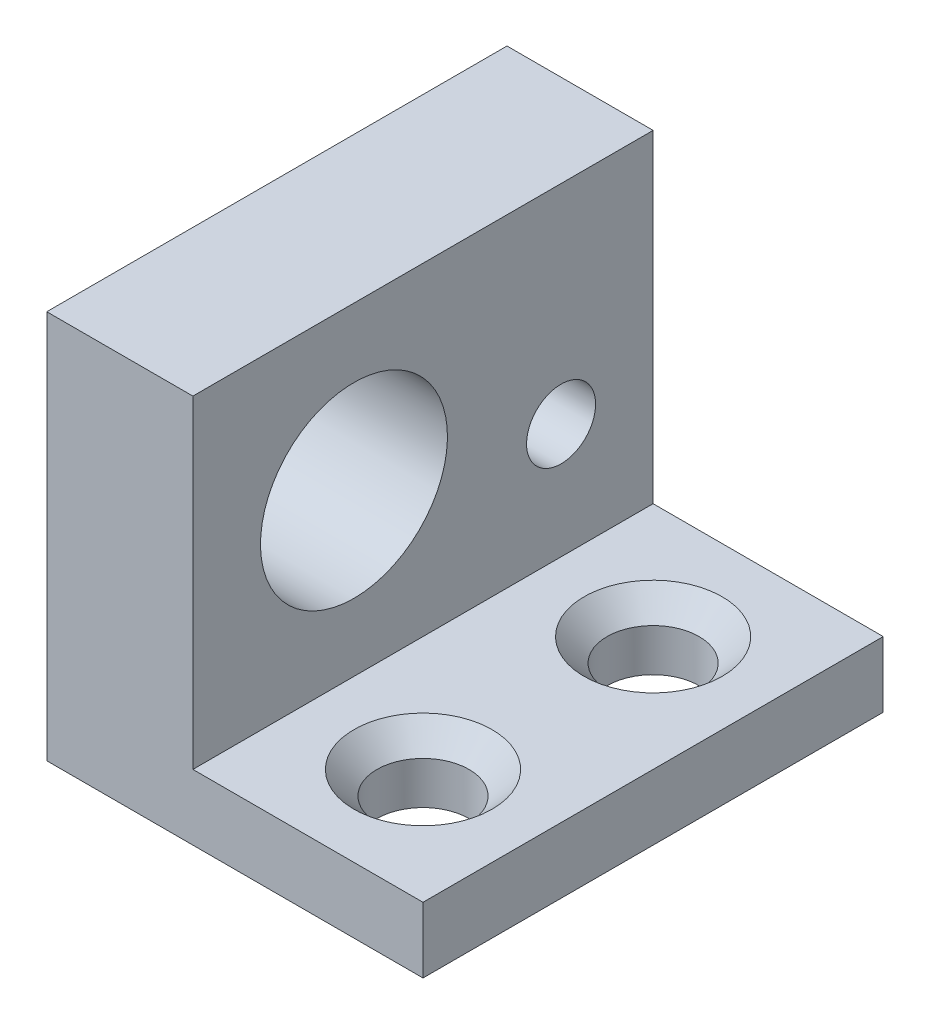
from build123d import *

# Parameters (mm, degrees)
BOSS_EXTRUDE1_DEPTH = 10
CUT_EXTRUDE1_REACH  = 39.287
SKETCH2_R           = 1.5
SKETCH2_R_2         = 4.0625
SKETCH4_W           = 25.4
SKETCH4_H           = 20
CUT_EXTRUDE3_DEPTH  = 3.5
SKETCH5_W           = 6.35
SKETCH5_H           = 20
CUT_EXTRUDE4_DEPTH  = 5
SKETCH7_W           = 9.05
SKETCH7_H           = 54.5
CUT_EXTRUDE5_DEPTH  = 30
CUT_EXTRUDE2_REACH  = 25.764
SKETCH3_R           = 2
CHAMFER1_SIZE       = 1


with BuildPart() as part:
    # Sketch1 → Boss-Extrude1 (new, symmetric)
    with BuildSketch(Plane.XY):
        Polygon((0, 25.4), (0, 0), (25.4, 0), (25.4, 6.35), (6.35, 6.35), (6.35, 25.4), align=None)
    extrude(amount=BOSS_EXTRUDE1_DEPTH, both=True)

    # Sketch2 → Cut-Extrude1 (cut, up to next)
    with BuildSketch(Plane.ZY, mode=Mode.PRIVATE) as cut_extrude1_sk1:
        with Locations(Location((-6, 11.35, 0), (0, 0, 270))):
            Circle(SKETCH2_R)
    cut_extrude1_tool1 = extrude(cut_extrude1_sk1.sketch, amount=-CUT_EXTRUDE1_REACH, mode=Mode.PRIVATE) & part.part
    # Sketch2 → Cut-Extrude1 (cut, up to next)
    with BuildSketch(Plane.ZY, mode=Mode.PRIVATE) as cut_extrude1_sk2:
        with Locations(Location((3, 13.35, 0), (0, 0, 270))):
            Circle(SKETCH2_R_2)
    cut_extrude1_tool2 = extrude(cut_extrude1_sk2.sketch, amount=-CUT_EXTRUDE1_REACH, mode=Mode.PRIVATE) & part.part
    add(cut_extrude1_tool1.solids().sort_by_distance((0, 11.35, -6))[0], mode=Mode.SUBTRACT)
    add(cut_extrude1_tool2.solids().sort_by_distance((0, 13.35, 3))[0], mode=Mode.SUBTRACT)

    # Sketch4 → Cut-Extrude3 (cut)
    with BuildSketch(Plane.XZ):
        with Locations((12.7, 0)):
            Rectangle(SKETCH4_W, SKETCH4_H)
    extrude(amount=-CUT_EXTRUDE3_DEPTH, mode=Mode.SUBTRACT)

    # Sketch5 → Cut-Extrude4 (cut)
    with BuildSketch(Plane(origin=(0, 25.4, 0), x_dir=(1, 0, 0), z_dir=(0, 1, 0))):
        with Locations((3.175, 0)):
            Rectangle(SKETCH5_W, SKETCH5_H)
    extrude(amount=-CUT_EXTRUDE4_DEPTH, mode=Mode.SUBTRACT)

    # Sketch7 → Cut-Extrude5 (cut)
    with BuildSketch(Plane(origin=(0, 6.35, 0), x_dir=(1, 0, 0), z_dir=(0, 1, 0))):
        with Locations((20.875, 17.25)):
            Rectangle(SKETCH7_W, SKETCH7_H)
    extrude(amount=-CUT_EXTRUDE5_DEPTH, mode=Mode.SUBTRACT)

    # Sketch3 → Cut-Extrude2 (cut, up to next)
    with BuildSketch(Plane(origin=(0, 6.35, 0), x_dir=(1, 0, 0), z_dir=(0, 1, 0)), mode=Mode.PRIVATE) as cut_extrude2_sk1:
        with Locations(Location((11.35, -5, 0), (0, 0, 180))):
            Circle(SKETCH3_R)
    cut_extrude2_tool1 = extrude(cut_extrude2_sk1.sketch, amount=-CUT_EXTRUDE2_REACH, mode=Mode.PRIVATE) & part.part
    # Sketch3 → Cut-Extrude2 (cut, up to next)
    with BuildSketch(Plane(origin=(0, 6.35, 0), x_dir=(1, 0, 0), z_dir=(0, 1, 0)), mode=Mode.PRIVATE) as cut_extrude2_sk2:
        with Locations(Location((11.35, 5, 0), (0, 0, 180))):
            Circle(SKETCH3_R)
    cut_extrude2_tool2 = extrude(cut_extrude2_sk2.sketch, amount=-CUT_EXTRUDE2_REACH, mode=Mode.PRIVATE) & part.part
    add(cut_extrude2_tool1.solids().sort_by_distance((11.35, 6.35, 5))[0], mode=Mode.SUBTRACT)
    add(cut_extrude2_tool2.solids().sort_by_distance((11.35, 6.35, -5))[0], mode=Mode.SUBTRACT)

    # Chamfer1
    chamfer1_edges = [part.edges().sort_by_distance(p)[0] for p in [
        (13.35, 6.35, 5),
        (13.35, 6.35, -5),
    ]]
    chamfer(chamfer1_edges, length=CHAMFER1_SIZE)


solid = part.part
